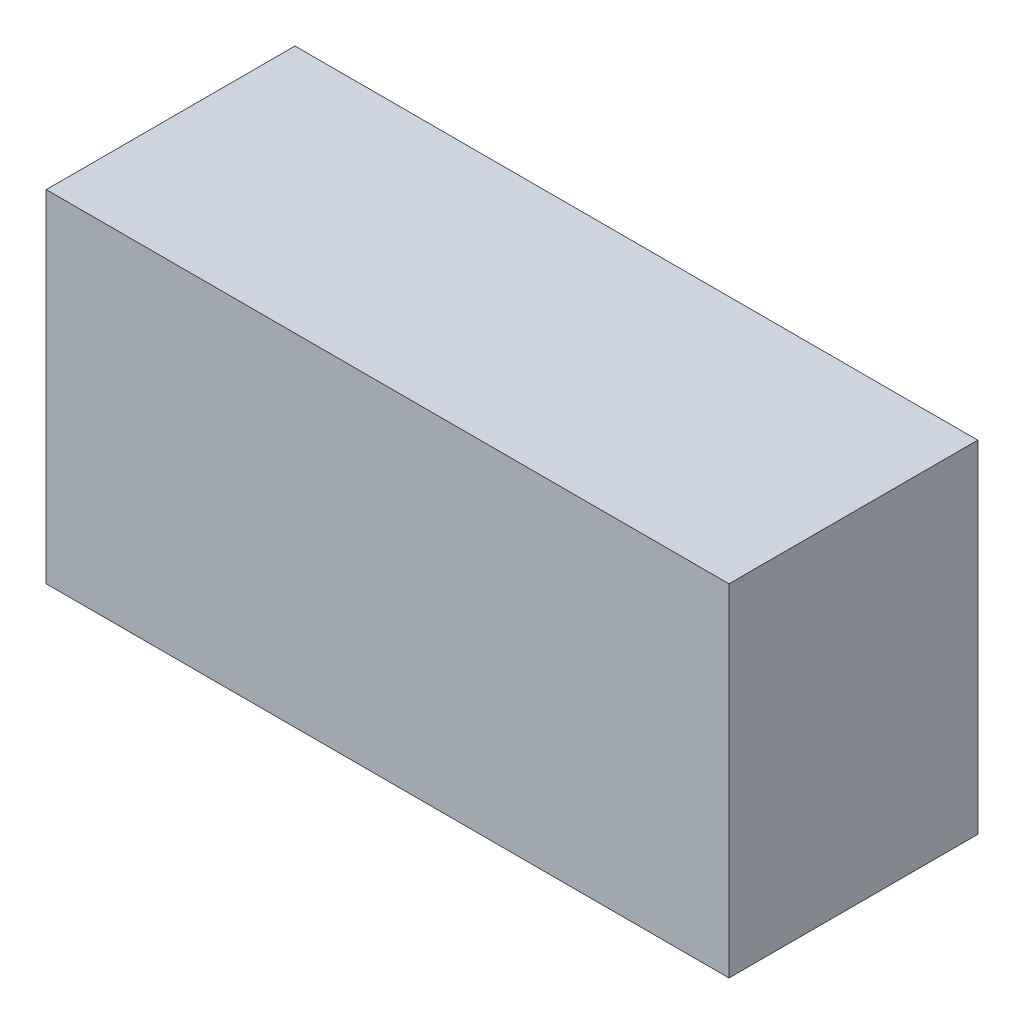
ISO-10303-21;
HEADER;
FILE_DESCRIPTION(('STEP AP214'),'2;1');
FILE_NAME('part.step','',(''),(''),'','','');
FILE_SCHEMA(('AUTOMOTIVE_DESIGN { 1 0 10303 214 1 1 1 1 }'));
ENDSEC;
DATA;
#1=APPLICATION_CONTEXT('core data for automotive mechanical design processes');
#2=APPLICATION_PROTOCOL_DEFINITION('international standard','automotive_design',2000,#1);
#3=PRODUCT_CONTEXT('',#1,'mechanical');
#4=PRODUCT('Part','Part','',(#3));
#5=PRODUCT_RELATED_PRODUCT_CATEGORY('part','',(#4));
#6=PRODUCT_DEFINITION_FORMATION('','',#4);
#7=PRODUCT_DEFINITION_CONTEXT('part definition',#1,'design');
#8=PRODUCT_DEFINITION('design','',#6,#7);
#9=PRODUCT_DEFINITION_SHAPE('','',#8);
#10=(LENGTH_UNIT() NAMED_UNIT(*) SI_UNIT(.MILLI.,.METRE.));
#11=(NAMED_UNIT(*) PLANE_ANGLE_UNIT() SI_UNIT($,.RADIAN.));
#12=(NAMED_UNIT(*) SI_UNIT($,.STERADIAN.) SOLID_ANGLE_UNIT());
#13=UNCERTAINTY_MEASURE_WITH_UNIT(LENGTH_MEASURE(1.E-05),#10,'distance_accuracy_value','');
#14=(GEOMETRIC_REPRESENTATION_CONTEXT(3) GLOBAL_UNCERTAINTY_ASSIGNED_CONTEXT((#13)) GLOBAL_UNIT_ASSIGNED_CONTEXT((#10,
#11,#12)) REPRESENTATION_CONTEXT('',''));
#15=CARTESIAN_POINT('',(0.,0.,0.));
#16=DIRECTION('',(0.,0.,1.));
#17=DIRECTION('',(1.,0.,0.));
#18=AXIS2_PLACEMENT_3D('',#15,#16,#17);
#19=CARTESIAN_POINT('',(0.,3048.,0.));
#20=DIRECTION('',(0.,0.,-1.));
#21=DIRECTION('',(-1.,0.,0.));
#22=AXIS2_PLACEMENT_3D('',#19,#20,#21);
#23=PLANE('',#22);
#24=DIRECTION('',(0.,1.,0.));
#25=VECTOR('',#24,1.);
#26=CARTESIAN_POINT('',(5791.2,3048.,0.));
#27=LINE('',#26,#25);
#28=CARTESIAN_POINT('',(5791.2,0.,0.));
#29=VERTEX_POINT('',#28);
#30=CARTESIAN_POINT('',(5791.2,2743.2,0.));
#31=VERTEX_POINT('',#30);
#32=EDGE_CURVE('E123',#29,#31,#27,.T.);
#33=ORIENTED_EDGE('',*,*,#32,.T.);
#34=DIRECTION('',(-1.,0.,0.));
#35=VECTOR('',#34,1.);
#36=CARTESIAN_POINT('',(0.,2743.2,0.));
#37=LINE('',#36,#35);
#38=CARTESIAN_POINT('',(0.,2743.2,0.));
#39=VERTEX_POINT('',#38);
#40=EDGE_CURVE('E47',#31,#39,#37,.T.);
#41=ORIENTED_EDGE('',*,*,#40,.T.);
#42=DIRECTION('',(0.,-1.,0.));
#43=VECTOR('',#42,1.);
#44=CARTESIAN_POINT('',(0.,0.,0.));
#45=LINE('',#44,#43);
#46=CARTESIAN_POINT('',(0.,3048.,0.));
#47=VERTEX_POINT('',#46);
#48=EDGE_CURVE('E126',#47,#39,#45,.T.);
#49=ORIENTED_EDGE('',*,*,#48,.F.);
#50=DIRECTION('',(-1.,0.,0.));
#51=VECTOR('',#50,1.);
#52=CARTESIAN_POINT('',(0.,3048.,0.));
#53=LINE('',#52,#51);
#54=CARTESIAN_POINT('',(6096.,3048.,0.));
#55=VERTEX_POINT('',#54);
#56=EDGE_CURVE('E74',#55,#47,#53,.T.);
#57=ORIENTED_EDGE('',*,*,#56,.F.);
#58=DIRECTION('',(0.,1.,0.));
#59=VECTOR('',#58,1.);
#60=CARTESIAN_POINT('',(6096.,0.,0.));
#61=LINE('',#60,#59);
#62=CARTESIAN_POINT('',(6096.,0.,0.));
#63=VERTEX_POINT('',#62);
#64=EDGE_CURVE('E141',#63,#55,#61,.T.);
#65=ORIENTED_EDGE('',*,*,#64,.F.);
#66=DIRECTION('',(1.,0.,0.));
#67=VECTOR('',#66,1.);
#68=CARTESIAN_POINT('',(0.,0.,0.));
#69=LINE('',#68,#67);
#70=EDGE_CURVE('E139',#29,#63,#69,.T.);
#71=ORIENTED_EDGE('',*,*,#70,.F.);
#72=EDGE_LOOP('',(#33,#41,#49,#57,#65,#71));
#73=FACE_BOUND('',#72,.T.);
#74=ADVANCED_FACE('F32',(#73),#23,.T.);
#75=CARTESIAN_POINT('',(0.,0.,2220.976));
#76=DIRECTION('',(1.,0.,0.));
#77=DIRECTION('',(0.,0.,-1.));
#78=AXIS2_PLACEMENT_3D('',#75,#76,#77);
#79=PLANE('',#78);
#80=DIRECTION('',(0.,0.,-1.));
#81=VECTOR('',#80,1.);
#82=CARTESIAN_POINT('',(0.,2743.2,2220.976));
#83=LINE('',#82,#81);
#84=CARTESIAN_POINT('',(0.,2743.2,1916.176));
#85=VERTEX_POINT('',#84);
#86=EDGE_CURVE('E114',#85,#39,#83,.T.);
#87=ORIENTED_EDGE('',*,*,#86,.F.);
#88=DIRECTION('',(0.,-1.,0.));
#89=VECTOR('',#88,1.);
#90=CARTESIAN_POINT('',(0.,3048.,1916.176));
#91=LINE('',#90,#89);
#92=CARTESIAN_POINT('',(0.,0.,1916.176));
#93=VERTEX_POINT('',#92);
#94=EDGE_CURVE('E118',#85,#93,#91,.T.);
#95=ORIENTED_EDGE('',*,*,#94,.T.);
#96=DIRECTION('',(0.,0.,-1.));
#97=VECTOR('',#96,1.);
#98=CARTESIAN_POINT('',(0.,0.,2220.976));
#99=LINE('',#98,#97);
#100=CARTESIAN_POINT('',(0.,0.,2220.976));
#101=VERTEX_POINT('',#100);
#102=EDGE_CURVE('E11',#101,#93,#99,.T.);
#103=ORIENTED_EDGE('',*,*,#102,.F.);
#104=DIRECTION('',(0.,-1.,0.));
#105=VECTOR('',#104,1.);
#106=CARTESIAN_POINT('',(0.,0.,2220.976));
#107=LINE('',#106,#105);
#108=CARTESIAN_POINT('',(0.,3048.,2220.976));
#109=VERTEX_POINT('',#108);
#110=EDGE_CURVE('E130',#109,#101,#107,.T.);
#111=ORIENTED_EDGE('',*,*,#110,.F.);
#112=DIRECTION('',(0.,0.,-1.));
#113=VECTOR('',#112,1.);
#114=CARTESIAN_POINT('',(0.,3048.,2220.976));
#115=LINE('',#114,#113);
#116=EDGE_CURVE('E136',#109,#47,#115,.T.);
#117=ORIENTED_EDGE('',*,*,#116,.T.);
#118=ORIENTED_EDGE('',*,*,#48,.T.);
#119=EDGE_LOOP('',(#87,#95,#103,#111,#117,#118));
#120=FACE_BOUND('',#119,.T.);
#121=ADVANCED_FACE('F34',(#120),#79,.F.);
#122=CARTESIAN_POINT('',(0.,0.,2220.976));
#123=DIRECTION('',(0.,1.,0.));
#124=DIRECTION('',(0.,0.,1.));
#125=AXIS2_PLACEMENT_3D('',#122,#123,#124);
#126=PLANE('',#125);
#127=DIRECTION('',(1.,0.,0.));
#128=VECTOR('',#127,1.);
#129=CARTESIAN_POINT('',(0.,0.,1916.176));
#130=LINE('',#129,#128);
#131=CARTESIAN_POINT('',(5791.2,0.,1916.176));
#132=VERTEX_POINT('',#131);
#133=EDGE_CURVE('E110',#93,#132,#130,.T.);
#134=ORIENTED_EDGE('',*,*,#133,.T.);
#135=DIRECTION('',(0.,0.,-1.));
#136=VECTOR('',#135,1.);
#137=CARTESIAN_POINT('',(5791.2,0.,2220.976));
#138=LINE('',#137,#136);
#139=EDGE_CURVE('E105',#132,#29,#138,.T.);
#140=ORIENTED_EDGE('',*,*,#139,.T.);
#141=ORIENTED_EDGE('',*,*,#70,.T.);
#142=DIRECTION('',(0.,0.,-1.));
#143=VECTOR('',#142,1.);
#144=CARTESIAN_POINT('',(6096.,0.,2220.976));
#145=LINE('',#144,#143);
#146=CARTESIAN_POINT('',(6096.,0.,2220.976));
#147=VERTEX_POINT('',#146);
#148=EDGE_CURVE('E40',#147,#63,#145,.T.);
#149=ORIENTED_EDGE('',*,*,#148,.F.);
#150=DIRECTION('',(1.,0.,0.));
#151=VECTOR('',#150,1.);
#152=CARTESIAN_POINT('',(0.,0.,2220.976));
#153=LINE('',#152,#151);
#154=EDGE_CURVE('E81',#101,#147,#153,.T.);
#155=ORIENTED_EDGE('',*,*,#154,.F.);
#156=ORIENTED_EDGE('',*,*,#102,.T.);
#157=EDGE_LOOP('',(#134,#140,#141,#149,#155,#156));
#158=FACE_BOUND('',#157,.T.);
#159=ADVANCED_FACE('F167',(#158),#126,.F.);
#160=CARTESIAN_POINT('',(6096.,0.,2220.976));
#161=DIRECTION('',(-1.,0.,0.));
#162=DIRECTION('',(0.,0.,1.));
#163=AXIS2_PLACEMENT_3D('',#160,#161,#162);
#164=PLANE('',#163);
#165=ORIENTED_EDGE('',*,*,#64,.T.);
#166=DIRECTION('',(0.,0.,-1.));
#167=VECTOR('',#166,1.);
#168=CARTESIAN_POINT('',(6096.,3048.,2220.976));
#169=LINE('',#168,#167);
#170=CARTESIAN_POINT('',(6096.,3048.,2220.976));
#171=VERTEX_POINT('',#170);
#172=EDGE_CURVE('E145',#171,#55,#169,.T.);
#173=ORIENTED_EDGE('',*,*,#172,.F.);
#174=DIRECTION('',(0.,1.,0.));
#175=VECTOR('',#174,1.);
#176=CARTESIAN_POINT('',(6096.,0.,2220.976));
#177=LINE('',#176,#175);
#178=EDGE_CURVE('E133',#147,#171,#177,.T.);
#179=ORIENTED_EDGE('',*,*,#178,.F.);
#180=ORIENTED_EDGE('',*,*,#148,.T.);
#181=EDGE_LOOP('',(#165,#173,#179,#180));
#182=FACE_BOUND('',#181,.T.);
#183=ADVANCED_FACE('F150',(#182),#164,.F.);
#184=CARTESIAN_POINT('',(0.,3048.,2220.976));
#185=DIRECTION('',(0.,-1.,0.));
#186=DIRECTION('',(0.,0.,-1.));
#187=AXIS2_PLACEMENT_3D('',#184,#185,#186);
#188=PLANE('',#187);
#189=ORIENTED_EDGE('',*,*,#56,.T.);
#190=ORIENTED_EDGE('',*,*,#116,.F.);
#191=DIRECTION('',(-1.,0.,0.));
#192=VECTOR('',#191,1.);
#193=CARTESIAN_POINT('',(0.,3048.,2220.976));
#194=LINE('',#193,#192);
#195=EDGE_CURVE('E56',#171,#109,#194,.T.);
#196=ORIENTED_EDGE('',*,*,#195,.F.);
#197=ORIENTED_EDGE('',*,*,#172,.T.);
#198=EDGE_LOOP('',(#189,#190,#196,#197));
#199=FACE_BOUND('',#198,.T.);
#200=ADVANCED_FACE('F158',(#199),#188,.F.);
#201=CARTESIAN_POINT('',(0.,3048.,2220.976));
#202=DIRECTION('',(0.,0.,-1.));
#203=DIRECTION('',(-1.,0.,0.));
#204=AXIS2_PLACEMENT_3D('',#201,#202,#203);
#205=PLANE('',#204);
#206=ORIENTED_EDGE('',*,*,#110,.T.);
#207=ORIENTED_EDGE('',*,*,#154,.T.);
#208=ORIENTED_EDGE('',*,*,#178,.T.);
#209=ORIENTED_EDGE('',*,*,#195,.T.);
#210=EDGE_LOOP('',(#206,#207,#208,#209));
#211=FACE_BOUND('',#210,.T.);
#212=ADVANCED_FACE('F160',(#211),#205,.F.);
#213=CARTESIAN_POINT('',(5791.2,0.,2220.976));
#214=DIRECTION('',(-1.,0.,0.));
#215=DIRECTION('',(0.,0.,1.));
#216=AXIS2_PLACEMENT_3D('',#213,#214,#215);
#217=PLANE('',#216);
#218=ORIENTED_EDGE('',*,*,#32,.F.);
#219=ORIENTED_EDGE('',*,*,#139,.F.);
#220=DIRECTION('',(0.,1.,0.));
#221=VECTOR('',#220,1.);
#222=CARTESIAN_POINT('',(5791.2,3048.,1916.176));
#223=LINE('',#222,#221);
#224=CARTESIAN_POINT('',(5791.2,2743.2,1916.176));
#225=VERTEX_POINT('',#224);
#226=EDGE_CURVE('E100',#132,#225,#223,.T.);
#227=ORIENTED_EDGE('',*,*,#226,.T.);
#228=DIRECTION('',(0.,0.,-1.));
#229=VECTOR('',#228,1.);
#230=CARTESIAN_POINT('',(5791.2,2743.2,2220.976));
#231=LINE('',#230,#229);
#232=EDGE_CURVE('E102',#225,#31,#231,.T.);
#233=ORIENTED_EDGE('',*,*,#232,.T.);
#234=EDGE_LOOP('',(#218,#219,#227,#233));
#235=FACE_BOUND('',#234,.T.);
#236=ADVANCED_FACE('F101',(#235),#217,.T.);
#237=CARTESIAN_POINT('',(0.,2743.2,2220.976));
#238=DIRECTION('',(0.,-1.,0.));
#239=DIRECTION('',(0.,0.,-1.));
#240=AXIS2_PLACEMENT_3D('',#237,#238,#239);
#241=PLANE('',#240);
#242=ORIENTED_EDGE('',*,*,#40,.F.);
#243=ORIENTED_EDGE('',*,*,#232,.F.);
#244=DIRECTION('',(-1.,0.,0.));
#245=VECTOR('',#244,1.);
#246=CARTESIAN_POINT('',(0.,2743.2,1916.176));
#247=LINE('',#246,#245);
#248=EDGE_CURVE('E109',#225,#85,#247,.T.);
#249=ORIENTED_EDGE('',*,*,#248,.T.);
#250=ORIENTED_EDGE('',*,*,#86,.T.);
#251=EDGE_LOOP('',(#242,#243,#249,#250));
#252=FACE_BOUND('',#251,.T.);
#253=ADVANCED_FACE('F112',(#252),#241,.T.);
#254=CARTESIAN_POINT('',(0.,3048.,1916.176));
#255=DIRECTION('',(0.,0.,-1.));
#256=DIRECTION('',(-1.,0.,0.));
#257=AXIS2_PLACEMENT_3D('',#254,#255,#256);
#258=PLANE('',#257);
#259=ORIENTED_EDGE('',*,*,#94,.F.);
#260=ORIENTED_EDGE('',*,*,#248,.F.);
#261=ORIENTED_EDGE('',*,*,#226,.F.);
#262=ORIENTED_EDGE('',*,*,#133,.F.);
#263=EDGE_LOOP('',(#259,#260,#261,#262));
#264=FACE_BOUND('',#263,.T.);
#265=ADVANCED_FACE('F116',(#264),#258,.T.);
#266=CLOSED_SHELL('',(#74,#121,#159,#183,#200,#212,#236,#253,#265));
#267=MANIFOLD_SOLID_BREP('B2',#266);
#268=ADVANCED_BREP_SHAPE_REPRESENTATION('',(#18,#267),#14);
#269=SHAPE_DEFINITION_REPRESENTATION(#9,#268);
ENDSEC;
END-ISO-10303-21;
